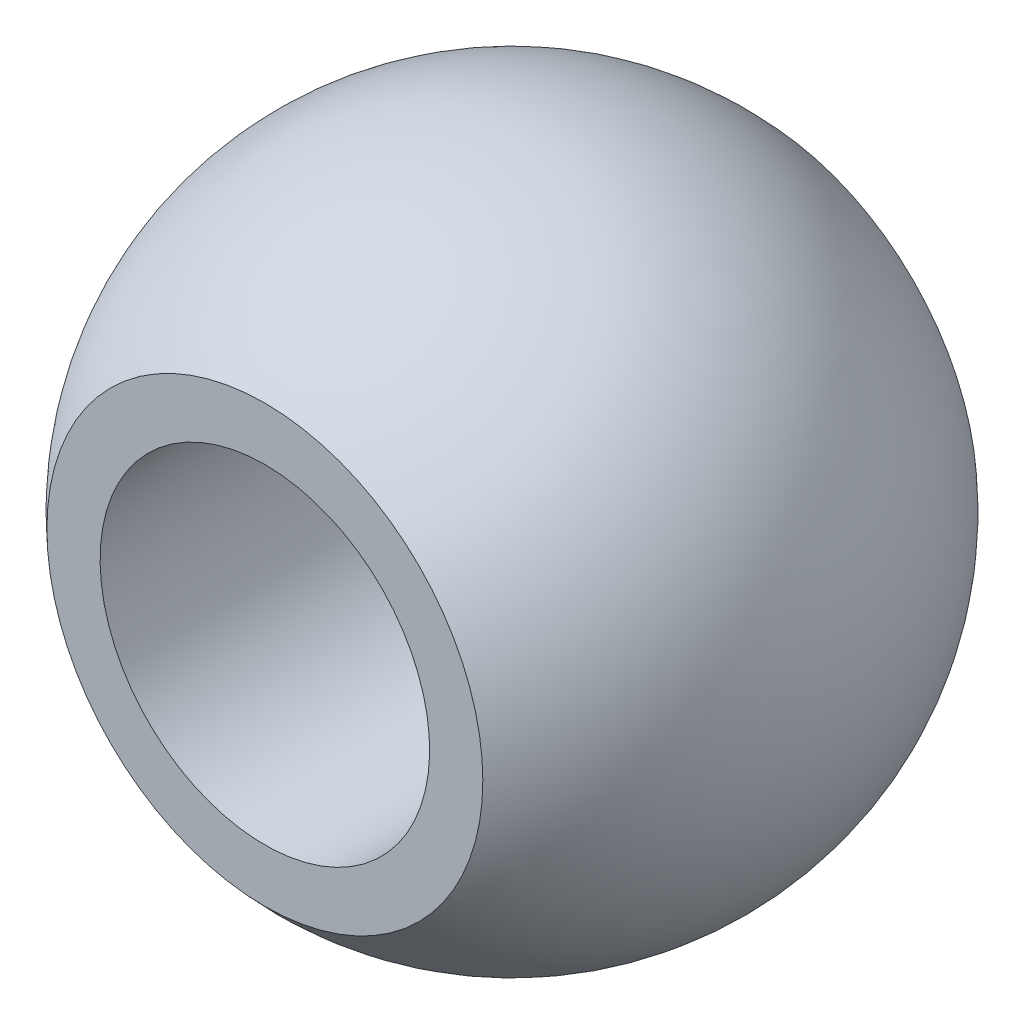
from build123d import *

# Parameters (mm, degrees)
CUT_EXTRUDE1_DEPTH      = 11.998522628
CUT_EXTRUDE1_DEPTH_BACK = 11.998522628
SKETCH2_R               = 3.175
CUT_EXTRUDE2_DEPTH      = 11.998522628
CUT_EXTRUDE2_DEPTH_BACK = 11.998522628
SKETCH3_W               = 6.832396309
SKETCH3_H               = 32.166679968


with BuildPart() as part:
    # Sketch1 → Base-Revolve (revolve)
    with BuildSketch(Plane.XY):
        with BuildLine():
            Line((0, 6.35), (0, -6.35))
            ThreePointArc((0, -6.35), (6.35, 0), (0, 6.35))
        make_face()
    revolve(axis=Axis((0, 50.8, 0), (0, -1, 0)))

    # Sketch2 → Cut-Extrude1 (cut, two sides: drawn at the far end of the back side and taken through both)
    with BuildSketch(Plane.XY.offset(-CUT_EXTRUDE1_DEPTH_BACK)):
        with Locations(Location((0, 0, 0), (0, 0, 90))):
            Circle(SKETCH2_R)
    extrude(amount=CUT_EXTRUDE1_DEPTH + CUT_EXTRUDE1_DEPTH_BACK, mode=Mode.SUBTRACT)

    # Sketch3 → Cut-Extrude2 (cut, two sides: drawn at the far end of the back side and taken through both)
    with BuildSketch(Plane(origin=(0, 0, 0), x_dir=(0, 0, -1), z_dir=(1, 0, 0)).offset(-CUT_EXTRUDE2_DEPTH_BACK)):
        with Locations((-8.178698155, -0.87672342)):
            Rectangle(SKETCH3_W, SKETCH3_H)
        with Locations((8.178698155, -0.87672342)):
            Rectangle(SKETCH3_W, SKETCH3_H)
    extrude(amount=CUT_EXTRUDE2_DEPTH + CUT_EXTRUDE2_DEPTH_BACK, mode=Mode.SUBTRACT)


solid = part.part
